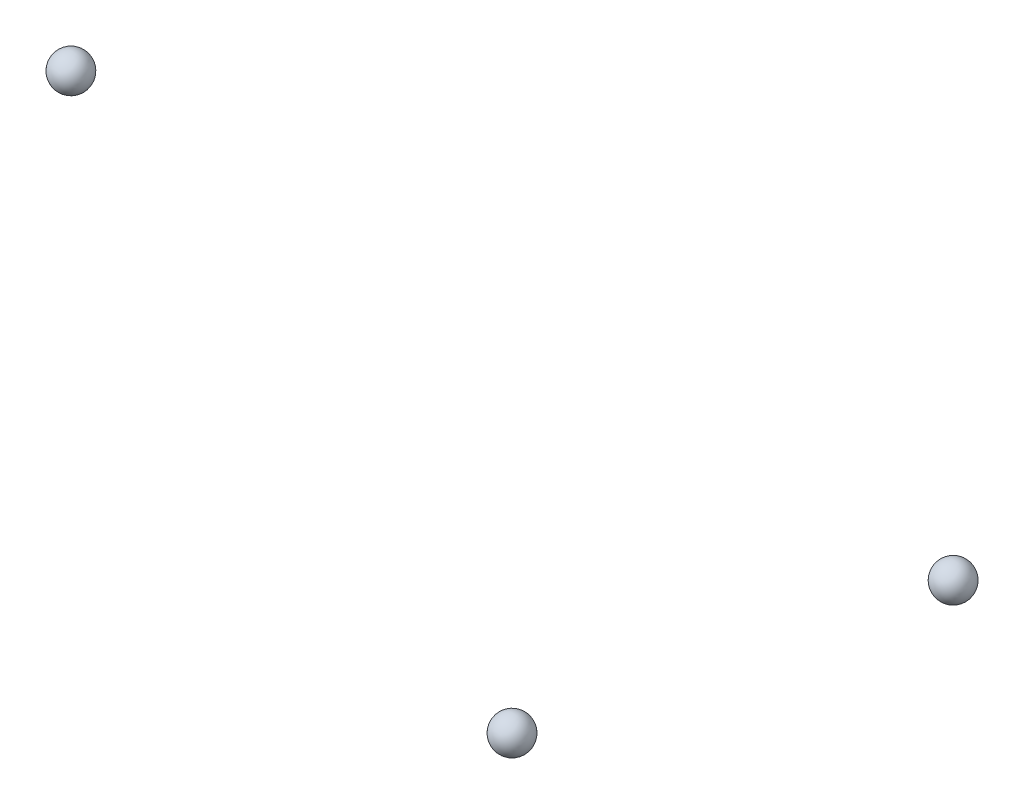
ISO-10303-21;
HEADER;
FILE_DESCRIPTION(('STEP AP214'),'2;1');
FILE_NAME('part.step','',(''),(''),'','','');
FILE_SCHEMA(('AUTOMOTIVE_DESIGN { 1 0 10303 214 1 1 1 1 }'));
ENDSEC;
DATA;
#1=APPLICATION_CONTEXT('core data for automotive mechanical design processes');
#2=APPLICATION_PROTOCOL_DEFINITION('international standard','automotive_design',2000,#1);
#3=PRODUCT_CONTEXT('',#1,'mechanical');
#4=PRODUCT('Part','Part','',(#3));
#5=PRODUCT_RELATED_PRODUCT_CATEGORY('part','',(#4));
#6=PRODUCT_DEFINITION_FORMATION('','',#4);
#7=PRODUCT_DEFINITION_CONTEXT('part definition',#1,'design');
#8=PRODUCT_DEFINITION('design','',#6,#7);
#9=PRODUCT_DEFINITION_SHAPE('','',#8);
#10=(LENGTH_UNIT() NAMED_UNIT(*) SI_UNIT(.MILLI.,.METRE.));
#11=(NAMED_UNIT(*) PLANE_ANGLE_UNIT() SI_UNIT($,.RADIAN.));
#12=(NAMED_UNIT(*) SI_UNIT($,.STERADIAN.) SOLID_ANGLE_UNIT());
#13=UNCERTAINTY_MEASURE_WITH_UNIT(LENGTH_MEASURE(1.E-05),#10,'distance_accuracy_value','');
#14=(GEOMETRIC_REPRESENTATION_CONTEXT(3) GLOBAL_UNCERTAINTY_ASSIGNED_CONTEXT((#13)) GLOBAL_UNIT_ASSIGNED_CONTEXT((#10,
#11,#12)) REPRESENTATION_CONTEXT('',''));
#15=CARTESIAN_POINT('',(0.,0.,0.));
#16=DIRECTION('',(0.,0.,1.));
#17=DIRECTION('',(1.,0.,0.));
#18=AXIS2_PLACEMENT_3D('',#15,#16,#17);
#19=CARTESIAN_POINT('',(-50.0000000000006,20.,-0.500000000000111));
#20=DIRECTION('',(0.,0.,1.));
#21=DIRECTION('',(-1.,0.,0.));
#22=AXIS2_PLACEMENT_3D('',#19,#20,#21);
#23=SPHERICAL_SURFACE('',#22,2.);
#24=CARTESIAN_POINT('',(-50.0000000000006,20.,1.49999999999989));
#25=VERTEX_POINT('',#24);
#26=VERTEX_LOOP('',#25);
#27=FACE_BOUND('',#26,.T.);
#28=ADVANCED_FACE('F37',(#27),#23,.T.);
#29=CLOSED_SHELL('',(#28));
#30=MANIFOLD_SOLID_BREP('B2',#29);
#31=CARTESIAN_POINT('',(50.0000000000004,20.,-0.500000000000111));
#32=DIRECTION('',(0.,0.,1.));
#33=DIRECTION('',(-1.,0.,0.));
#34=AXIS2_PLACEMENT_3D('',#31,#32,#33);
#35=SPHERICAL_SURFACE('',#34,2.);
#36=CARTESIAN_POINT('',(50.0000000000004,20.,1.49999999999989));
#37=VERTEX_POINT('',#36);
#38=VERTEX_LOOP('',#37);
#39=FACE_BOUND('',#38,.T.);
#40=ADVANCED_FACE('F54',(#39),#35,.T.);
#41=CLOSED_SHELL('',(#40));
#42=MANIFOLD_SOLID_BREP('B6',#41);
#43=CARTESIAN_POINT('',(0.,-20.,-0.5));
#44=DIRECTION('',(0.,0.,1.));
#45=DIRECTION('',(-1.,0.,0.));
#46=AXIS2_PLACEMENT_3D('',#43,#44,#45);
#47=SPHERICAL_SURFACE('',#46,2.);
#48=CARTESIAN_POINT('',(0.,-20.,1.5));
#49=VERTEX_POINT('',#48);
#50=VERTEX_LOOP('',#49);
#51=FACE_BOUND('',#50,.T.);
#52=ADVANCED_FACE('F66',(#51),#47,.T.);
#53=CLOSED_SHELL('',(#52));
#54=MANIFOLD_SOLID_BREP('B33',#53);
#55=ADVANCED_BREP_SHAPE_REPRESENTATION('',(#18,#30,#42,#54),#14);
#56=SHAPE_DEFINITION_REPRESENTATION(#9,#55);
ENDSEC;
END-ISO-10303-21;
